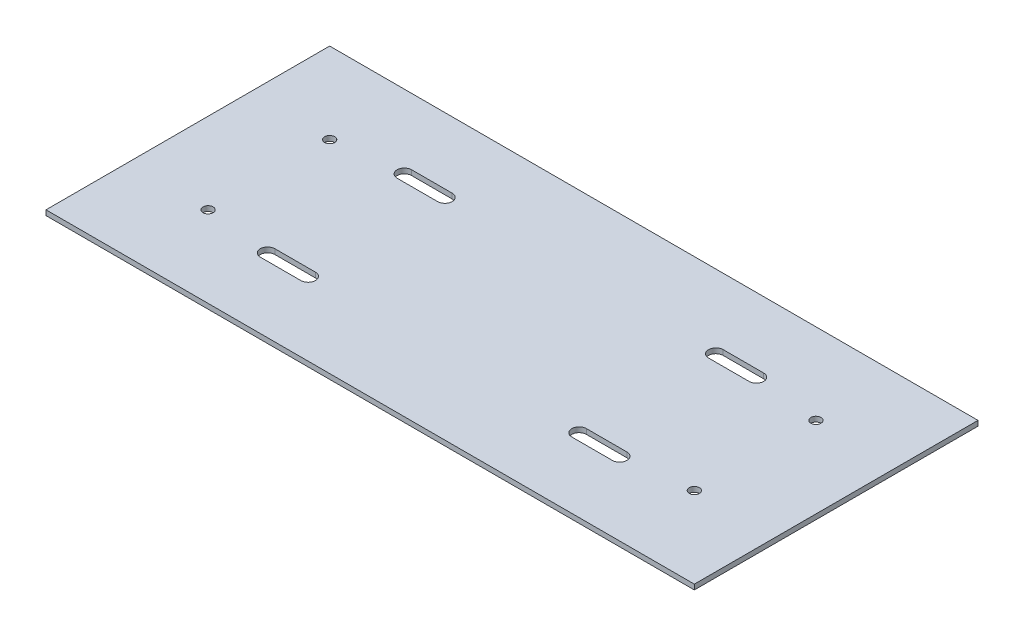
ISO-10303-21;
HEADER;
FILE_DESCRIPTION(('STEP AP214'),'2;1');
FILE_NAME('part.step','',(''),(''),'','','');
FILE_SCHEMA(('AUTOMOTIVE_DESIGN { 1 0 10303 214 1 1 1 1 }'));
ENDSEC;
DATA;
#1=APPLICATION_CONTEXT('core data for automotive mechanical design processes');
#2=APPLICATION_PROTOCOL_DEFINITION('international standard','automotive_design',2000,#1);
#3=PRODUCT_CONTEXT('',#1,'mechanical');
#4=PRODUCT('Part','Part','',(#3));
#5=PRODUCT_RELATED_PRODUCT_CATEGORY('part','',(#4));
#6=PRODUCT_DEFINITION_FORMATION('','',#4);
#7=PRODUCT_DEFINITION_CONTEXT('part definition',#1,'design');
#8=PRODUCT_DEFINITION('design','',#6,#7);
#9=PRODUCT_DEFINITION_SHAPE('','',#8);
#10=(LENGTH_UNIT() NAMED_UNIT(*) SI_UNIT(.MILLI.,.METRE.));
#11=(NAMED_UNIT(*) PLANE_ANGLE_UNIT() SI_UNIT($,.RADIAN.));
#12=(NAMED_UNIT(*) SI_UNIT($,.STERADIAN.) SOLID_ANGLE_UNIT());
#13=UNCERTAINTY_MEASURE_WITH_UNIT(LENGTH_MEASURE(1.E-05),#10,'distance_accuracy_value','');
#14=(GEOMETRIC_REPRESENTATION_CONTEXT(3) GLOBAL_UNCERTAINTY_ASSIGNED_CONTEXT((#13)) GLOBAL_UNIT_ASSIGNED_CONTEXT((#10,
#11,#12)) REPRESENTATION_CONTEXT('',''));
#15=CARTESIAN_POINT('',(0.,0.,0.));
#16=DIRECTION('',(0.,0.,1.));
#17=DIRECTION('',(1.,0.,0.));
#18=AXIS2_PLACEMENT_3D('',#15,#16,#17);
#19=CARTESIAN_POINT('',(-203.2,3.175,177.8));
#20=DIRECTION('',(1.,0.,0.));
#21=DIRECTION('',(0.,0.,-1.));
#22=AXIS2_PLACEMENT_3D('',#19,#20,#21);
#23=PLANE('',#22);
#24=DIRECTION('',(0.,0.,-1.));
#25=VECTOR('',#24,1.);
#26=CARTESIAN_POINT('',(-203.2,0.,177.8));
#27=LINE('',#26,#25);
#28=CARTESIAN_POINT('',(-203.2,0.,88.9));
#29=VERTEX_POINT('',#28);
#30=CARTESIAN_POINT('',(-203.2,0.,-88.9));
#31=VERTEX_POINT('',#30);
#32=EDGE_CURVE('E11',#29,#31,#27,.T.);
#33=ORIENTED_EDGE('',*,*,#32,.F.);
#34=DIRECTION('',(0.,1.,0.));
#35=VECTOR('',#34,1.);
#36=CARTESIAN_POINT('',(-203.2,-0.00100000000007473,88.9));
#37=LINE('',#36,#35);
#38=CARTESIAN_POINT('',(-203.2,3.175,88.9));
#39=VERTEX_POINT('',#38);
#40=EDGE_CURVE('E331',#29,#39,#37,.T.);
#41=ORIENTED_EDGE('',*,*,#40,.T.);
#42=DIRECTION('',(0.,0.,-1.));
#43=VECTOR('',#42,1.);
#44=CARTESIAN_POINT('',(-203.2,3.175,177.8));
#45=LINE('',#44,#43);
#46=CARTESIAN_POINT('',(-203.2,3.175,-88.8999999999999));
#47=VERTEX_POINT('',#46);
#48=EDGE_CURVE('E347',#39,#47,#45,.T.);
#49=ORIENTED_EDGE('',*,*,#48,.T.);
#50=DIRECTION('',(0.,1.,0.));
#51=VECTOR('',#50,1.);
#52=CARTESIAN_POINT('',(-203.2,-0.00100000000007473,-88.9));
#53=LINE('',#52,#51);
#54=EDGE_CURVE('E343',#31,#47,#53,.T.);
#55=ORIENTED_EDGE('',*,*,#54,.F.);
#56=EDGE_LOOP('',(#33,#41,#49,#55));
#57=FACE_BOUND('',#56,.T.);
#58=ADVANCED_FACE('F35',(#57),#23,.F.);
#59=CARTESIAN_POINT('',(-203.2,0.,177.8));
#60=DIRECTION('',(0.,1.,0.));
#61=DIRECTION('',(-1.,0.,0.));
#62=AXIS2_PLACEMENT_3D('',#59,#60,#61);
#63=PLANE('',#62);
#64=DIRECTION('',(-1.,0.,0.));
#65=VECTOR('',#64,1.);
#66=CARTESIAN_POINT('',(110.337600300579,0.,-47.4345));
#67=LINE('',#66,#65);
#68=CARTESIAN_POINT('',(110.337600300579,0.,-47.4345));
#69=VERTEX_POINT('',#68);
#70=CARTESIAN_POINT('',(84.9375996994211,0.,-47.4345));
#71=VERTEX_POINT('',#70);
#72=EDGE_CURVE('E182',#69,#71,#67,.T.);
#73=ORIENTED_EDGE('',*,*,#72,.T.);
#74=CARTESIAN_POINT('',(84.9376003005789,0.,-42.8625));
#75=DIRECTION('',(0.,1.,0.));
#76=DIRECTION('',(1.,0.,0.));
#77=AXIS2_PLACEMENT_3D('',#74,#75,#76);
#78=CIRCLE('',#77,4.57200000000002);
#79=CARTESIAN_POINT('',(84.9376003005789,0.,-38.2905));
#80=VERTEX_POINT('',#79);
#81=EDGE_CURVE('E174',#71,#80,#78,.T.);
#82=ORIENTED_EDGE('',*,*,#81,.T.);
#83=DIRECTION('',(1.,0.,0.));
#84=VECTOR('',#83,1.);
#85=CARTESIAN_POINT('',(110.337600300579,0.,-38.2905));
#86=LINE('',#85,#84);
#87=CARTESIAN_POINT('',(110.337600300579,0.,-38.2905));
#88=VERTEX_POINT('',#87);
#89=EDGE_CURVE('E185',#80,#88,#86,.T.);
#90=ORIENTED_EDGE('',*,*,#89,.T.);
#91=CARTESIAN_POINT('',(110.337600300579,0.,-42.8625));
#92=DIRECTION('',(0.,1.,0.));
#93=DIRECTION('',(1.,0.,0.));
#94=AXIS2_PLACEMENT_3D('',#91,#92,#93);
#95=CIRCLE('',#94,4.57199999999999);
#96=EDGE_CURVE('E49',#88,#69,#95,.T.);
#97=ORIENTED_EDGE('',*,*,#96,.T.);
#98=EDGE_LOOP('',(#73,#82,#90,#97));
#99=FACE_BOUND('',#98,.T.);
#100=DIRECTION('',(1.,0.,0.));
#101=VECTOR('',#100,1.);
#102=CARTESIAN_POINT('',(110.337600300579,0.,47.4345));
#103=LINE('',#102,#101);
#104=CARTESIAN_POINT('',(84.9375996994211,0.,47.4345));
#105=VERTEX_POINT('',#104);
#106=CARTESIAN_POINT('',(110.337600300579,0.,47.4345));
#107=VERTEX_POINT('',#106);
#108=EDGE_CURVE('E220',#105,#107,#103,.T.);
#109=ORIENTED_EDGE('',*,*,#108,.T.);
#110=CARTESIAN_POINT('',(110.337600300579,0.,42.8625));
#111=DIRECTION('',(0.,1.,0.));
#112=DIRECTION('',(-1.,0.,0.));
#113=AXIS2_PLACEMENT_3D('',#110,#111,#112);
#114=CIRCLE('',#113,4.57199999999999);
#115=CARTESIAN_POINT('',(110.337600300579,0.,38.2905));
#116=VERTEX_POINT('',#115);
#117=EDGE_CURVE('E212',#107,#116,#114,.T.);
#118=ORIENTED_EDGE('',*,*,#117,.T.);
#119=DIRECTION('',(-1.,0.,0.));
#120=VECTOR('',#119,1.);
#121=CARTESIAN_POINT('',(110.337600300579,0.,38.2905));
#122=LINE('',#121,#120);
#123=CARTESIAN_POINT('',(84.9376003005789,0.,38.2905));
#124=VERTEX_POINT('',#123);
#125=EDGE_CURVE('E215',#116,#124,#122,.T.);
#126=ORIENTED_EDGE('',*,*,#125,.T.);
#127=CARTESIAN_POINT('',(84.9376003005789,0.,42.8625));
#128=DIRECTION('',(0.,1.,0.));
#129=DIRECTION('',(-1.,0.,0.));
#130=AXIS2_PLACEMENT_3D('',#127,#128,#129);
#131=CIRCLE('',#130,4.57200000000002);
#132=EDGE_CURVE('E57',#124,#105,#131,.T.);
#133=ORIENTED_EDGE('',*,*,#132,.T.);
#134=EDGE_LOOP('',(#109,#118,#126,#133));
#135=FACE_BOUND('',#134,.T.);
#136=DIRECTION('',(1.,0.,0.));
#137=VECTOR('',#136,1.);
#138=CARTESIAN_POINT('',(-110.337600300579,-1.23599047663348E-13,47.4345));
#139=LINE('',#138,#137);
#140=CARTESIAN_POINT('',(-110.337600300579,-1.23599047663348E-13,47.4345));
#141=VERTEX_POINT('',#140);
#142=CARTESIAN_POINT('',(-84.9375996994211,-1.18828558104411E-13,47.4345));
#143=VERTEX_POINT('',#142);
#144=EDGE_CURVE('E252',#141,#143,#139,.T.);
#145=ORIENTED_EDGE('',*,*,#144,.T.);
#146=CARTESIAN_POINT('',(-84.9376003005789,-1.18828558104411E-13,42.8625));
#147=DIRECTION('',(0.,1.,0.));
#148=DIRECTION('',(1.,0.,0.));
#149=AXIS2_PLACEMENT_3D('',#146,#147,#148);
#150=CIRCLE('',#149,4.57200000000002);
#151=CARTESIAN_POINT('',(-84.9376003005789,-1.18828558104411E-13,38.2905));
#152=VERTEX_POINT('',#151);
#153=EDGE_CURVE('E242',#143,#152,#150,.T.);
#154=ORIENTED_EDGE('',*,*,#153,.T.);
#155=DIRECTION('',(-1.,0.,0.));
#156=VECTOR('',#155,1.);
#157=CARTESIAN_POINT('',(-110.337600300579,-1.23599047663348E-13,38.2905));
#158=LINE('',#157,#156);
#159=CARTESIAN_POINT('',(-110.337600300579,0.,38.2905));
#160=VERTEX_POINT('',#159);
#161=EDGE_CURVE('E245',#152,#160,#158,.T.);
#162=ORIENTED_EDGE('',*,*,#161,.T.);
#163=CARTESIAN_POINT('',(-110.337600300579,-1.23599047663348E-13,42.8625));
#164=DIRECTION('',(0.,1.,0.));
#165=DIRECTION('',(1.,0.,0.));
#166=AXIS2_PLACEMENT_3D('',#163,#164,#165);
#167=CIRCLE('',#166,4.57199999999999);
#168=EDGE_CURVE('E249',#160,#141,#167,.T.);
#169=ORIENTED_EDGE('',*,*,#168,.T.);
#170=EDGE_LOOP('',(#145,#154,#162,#169));
#171=FACE_BOUND('',#170,.T.);
#172=DIRECTION('',(-1.,0.,0.));
#173=VECTOR('',#172,1.);
#174=CARTESIAN_POINT('',(-110.337600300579,-1.23599047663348E-13,-47.4345));
#175=LINE('',#174,#173);
#176=CARTESIAN_POINT('',(-84.9375996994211,-1.18828558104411E-13,-47.4345));
#177=VERTEX_POINT('',#176);
#178=CARTESIAN_POINT('',(-110.337600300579,-1.23599047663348E-13,-47.4345));
#179=VERTEX_POINT('',#178);
#180=EDGE_CURVE('E283',#177,#179,#175,.T.);
#181=ORIENTED_EDGE('',*,*,#180,.T.);
#182=CARTESIAN_POINT('',(-110.337600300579,-1.23599047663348E-13,-42.8625));
#183=DIRECTION('',(0.,1.,0.));
#184=DIRECTION('',(-1.,0.,0.));
#185=AXIS2_PLACEMENT_3D('',#182,#183,#184);
#186=CIRCLE('',#185,4.57199999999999);
#187=CARTESIAN_POINT('',(-110.337600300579,-1.23599047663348E-13,-38.2905));
#188=VERTEX_POINT('',#187);
#189=EDGE_CURVE('E273',#179,#188,#186,.T.);
#190=ORIENTED_EDGE('',*,*,#189,.T.);
#191=DIRECTION('',(1.,0.,0.));
#192=VECTOR('',#191,1.);
#193=CARTESIAN_POINT('',(-110.337600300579,-1.23599047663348E-13,-38.2905));
#194=LINE('',#193,#192);
#195=CARTESIAN_POINT('',(-84.9376003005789,0.,-38.2905));
#196=VERTEX_POINT('',#195);
#197=EDGE_CURVE('E276',#188,#196,#194,.T.);
#198=ORIENTED_EDGE('',*,*,#197,.T.);
#199=CARTESIAN_POINT('',(-84.9376003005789,-1.18828558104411E-13,-42.8625));
#200=DIRECTION('',(0.,1.,0.));
#201=DIRECTION('',(-1.,0.,0.));
#202=AXIS2_PLACEMENT_3D('',#199,#200,#201);
#203=CIRCLE('',#202,4.57200000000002);
#204=EDGE_CURVE('E280',#196,#177,#203,.T.);
#205=ORIENTED_EDGE('',*,*,#204,.T.);
#206=EDGE_LOOP('',(#181,#190,#198,#205));
#207=FACE_BOUND('',#206,.T.);
#208=CARTESIAN_POINT('',(-152.4,0.,38.1));
#209=DIRECTION('',(0.,1.,0.));
#210=DIRECTION('',(-1.,0.,0.));
#211=AXIS2_PLACEMENT_3D('',#208,#209,#210);
#212=CIRCLE('',#211,3.17499999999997);
#213=CARTESIAN_POINT('',(-155.575,0.,38.1));
#214=VERTEX_POINT('',#213);
#215=EDGE_CURVE('E305',#214,#214,#212,.T.);
#216=ORIENTED_EDGE('',*,*,#215,.T.);
#217=EDGE_LOOP('',(#216));
#218=FACE_BOUND('',#217,.T.);
#219=CARTESIAN_POINT('',(152.4,0.,38.1));
#220=DIRECTION('',(0.,1.,0.));
#221=DIRECTION('',(1.,0.,0.));
#222=AXIS2_PLACEMENT_3D('',#219,#220,#221);
#223=CIRCLE('',#222,3.17499999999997);
#224=CARTESIAN_POINT('',(155.575,0.,38.1));
#225=VERTEX_POINT('',#224);
#226=EDGE_CURVE('E312',#225,#225,#223,.T.);
#227=ORIENTED_EDGE('',*,*,#226,.T.);
#228=EDGE_LOOP('',(#227));
#229=FACE_BOUND('',#228,.T.);
#230=CARTESIAN_POINT('',(152.4,0.,-38.1));
#231=DIRECTION('',(0.,1.,0.));
#232=DIRECTION('',(1.,0.,0.));
#233=AXIS2_PLACEMENT_3D('',#230,#231,#232);
#234=CIRCLE('',#233,3.175);
#235=CARTESIAN_POINT('',(155.575,0.,-38.1));
#236=VERTEX_POINT('',#235);
#237=EDGE_CURVE('E318',#236,#236,#234,.T.);
#238=ORIENTED_EDGE('',*,*,#237,.T.);
#239=EDGE_LOOP('',(#238));
#240=FACE_BOUND('',#239,.T.);
#241=CARTESIAN_POINT('',(-152.4,0.,-38.1));
#242=DIRECTION('',(0.,1.,0.));
#243=DIRECTION('',(-1.,0.,0.));
#244=AXIS2_PLACEMENT_3D('',#241,#242,#243);
#245=CIRCLE('',#244,3.175);
#246=CARTESIAN_POINT('',(-155.575,0.,-38.1));
#247=VERTEX_POINT('',#246);
#248=EDGE_CURVE('E323',#247,#247,#245,.T.);
#249=ORIENTED_EDGE('',*,*,#248,.T.);
#250=EDGE_LOOP('',(#249));
#251=FACE_BOUND('',#250,.T.);
#252=DIRECTION('',(0.,0.,-1.));
#253=VECTOR('',#252,1.);
#254=CARTESIAN_POINT('',(203.2,0.,177.8));
#255=LINE('',#254,#253);
#256=CARTESIAN_POINT('',(203.2,0.,88.9));
#257=VERTEX_POINT('',#256);
#258=CARTESIAN_POINT('',(203.2,0.,-88.9));
#259=VERTEX_POINT('',#258);
#260=EDGE_CURVE('E42',#257,#259,#255,.T.);
#261=ORIENTED_EDGE('',*,*,#260,.F.);
#262=DIRECTION('',(1.,0.,0.));
#263=VECTOR('',#262,1.);
#264=CARTESIAN_POINT('',(-203.2,0.,88.9));
#265=LINE('',#264,#263);
#266=EDGE_CURVE('E334',#29,#257,#265,.T.);
#267=ORIENTED_EDGE('',*,*,#266,.F.);
#268=ORIENTED_EDGE('',*,*,#32,.T.);
#269=DIRECTION('',(-1.,0.,0.));
#270=VECTOR('',#269,1.);
#271=CARTESIAN_POINT('',(-203.2,0.,-88.9));
#272=LINE('',#271,#270);
#273=EDGE_CURVE('E337',#259,#31,#272,.T.);
#274=ORIENTED_EDGE('',*,*,#273,.F.);
#275=EDGE_LOOP('',(#261,#267,#268,#274));
#276=FACE_BOUND('',#275,.T.);
#277=ADVANCED_FACE('F189',(#99,#135,#171,#207,#218,#229,#240,#251,#276),#63,.F.);
#278=CARTESIAN_POINT('',(203.2,0.,177.8));
#279=DIRECTION('',(-1.,0.,0.));
#280=DIRECTION('',(0.,0.,1.));
#281=AXIS2_PLACEMENT_3D('',#278,#279,#280);
#282=PLANE('',#281);
#283=DIRECTION('',(0.,0.,-1.));
#284=VECTOR('',#283,1.);
#285=CARTESIAN_POINT('',(203.2,3.17500000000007,177.8));
#286=LINE('',#285,#284);
#287=CARTESIAN_POINT('',(203.2,3.17500000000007,88.9));
#288=VERTEX_POINT('',#287);
#289=CARTESIAN_POINT('',(203.2,3.17500000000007,-88.9));
#290=VERTEX_POINT('',#289);
#291=EDGE_CURVE('E351',#288,#290,#286,.T.);
#292=ORIENTED_EDGE('',*,*,#291,.F.);
#293=DIRECTION('',(0.,1.,0.));
#294=VECTOR('',#293,1.);
#295=CARTESIAN_POINT('',(203.2,-0.00100000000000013,88.9));
#296=LINE('',#295,#294);
#297=EDGE_CURVE('E330',#257,#288,#296,.T.);
#298=ORIENTED_EDGE('',*,*,#297,.F.);
#299=ORIENTED_EDGE('',*,*,#260,.T.);
#300=DIRECTION('',(0.,1.,0.));
#301=VECTOR('',#300,1.);
#302=CARTESIAN_POINT('',(203.2,-0.00100000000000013,-88.9));
#303=LINE('',#302,#301);
#304=EDGE_CURVE('E344',#259,#290,#303,.T.);
#305=ORIENTED_EDGE('',*,*,#304,.T.);
#306=EDGE_LOOP('',(#292,#298,#299,#305));
#307=FACE_BOUND('',#306,.T.);
#308=ADVANCED_FACE('F357',(#307),#282,.F.);
#309=CARTESIAN_POINT('',(203.2,3.17500000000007,177.8));
#310=DIRECTION('',(0.,-1.,0.));
#311=DIRECTION('',(1.,0.,0.));
#312=AXIS2_PLACEMENT_3D('',#309,#310,#311);
#313=PLANE('',#312);
#314=DIRECTION('',(1.,0.,0.));
#315=VECTOR('',#314,1.);
#316=CARTESIAN_POINT('',(110.337600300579,3.17500000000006,-38.2905));
#317=LINE('',#316,#315);
#318=CARTESIAN_POINT('',(84.9376003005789,3.17500000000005,-38.2905));
#319=VERTEX_POINT('',#318);
#320=CARTESIAN_POINT('',(110.337600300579,3.17500000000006,-38.2905));
#321=VERTEX_POINT('',#320);
#322=EDGE_CURVE('E201',#319,#321,#317,.T.);
#323=ORIENTED_EDGE('',*,*,#322,.F.);
#324=CARTESIAN_POINT('',(84.9376003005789,3.17500000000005,-42.8625));
#325=DIRECTION('',(0.,1.,0.));
#326=DIRECTION('',(1.,0.,0.));
#327=AXIS2_PLACEMENT_3D('',#324,#325,#326);
#328=CIRCLE('',#327,4.57200000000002);
#329=CARTESIAN_POINT('',(84.9375996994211,3.17500000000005,-47.4345));
#330=VERTEX_POINT('',#329);
#331=EDGE_CURVE('E177',#330,#319,#328,.T.);
#332=ORIENTED_EDGE('',*,*,#331,.F.);
#333=DIRECTION('',(-1.,0.,0.));
#334=VECTOR('',#333,1.);
#335=CARTESIAN_POINT('',(110.337600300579,3.17500000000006,-47.4345));
#336=LINE('',#335,#334);
#337=CARTESIAN_POINT('',(110.337600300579,3.17500000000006,-47.4345));
#338=VERTEX_POINT('',#337);
#339=EDGE_CURVE('E192',#338,#330,#336,.T.);
#340=ORIENTED_EDGE('',*,*,#339,.F.);
#341=CARTESIAN_POINT('',(110.337600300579,3.17500000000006,-42.8625));
#342=DIRECTION('',(0.,1.,0.));
#343=DIRECTION('',(1.,0.,0.));
#344=AXIS2_PLACEMENT_3D('',#341,#342,#343);
#345=CIRCLE('',#344,4.57199999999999);
#346=EDGE_CURVE('E195',#321,#338,#345,.T.);
#347=ORIENTED_EDGE('',*,*,#346,.F.);
#348=EDGE_LOOP('',(#323,#332,#340,#347));
#349=FACE_BOUND('',#348,.T.);
#350=DIRECTION('',(-1.,0.,0.));
#351=VECTOR('',#350,1.);
#352=CARTESIAN_POINT('',(110.337600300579,3.17500000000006,38.2905));
#353=LINE('',#352,#351);
#354=CARTESIAN_POINT('',(110.337600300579,3.17500000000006,38.2905));
#355=VERTEX_POINT('',#354);
#356=CARTESIAN_POINT('',(84.9376003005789,3.17500000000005,38.2905));
#357=VERTEX_POINT('',#356);
#358=EDGE_CURVE('E226',#355,#357,#353,.T.);
#359=ORIENTED_EDGE('',*,*,#358,.F.);
#360=CARTESIAN_POINT('',(110.337600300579,3.17500000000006,42.8625));
#361=DIRECTION('',(0.,1.,0.));
#362=DIRECTION('',(-1.,0.,0.));
#363=AXIS2_PLACEMENT_3D('',#360,#361,#362);
#364=CIRCLE('',#363,4.57199999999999);
#365=CARTESIAN_POINT('',(110.337600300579,3.17500000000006,47.4345));
#366=VERTEX_POINT('',#365);
#367=EDGE_CURVE('E224',#366,#355,#364,.T.);
#368=ORIENTED_EDGE('',*,*,#367,.F.);
#369=DIRECTION('',(1.,0.,0.));
#370=VECTOR('',#369,1.);
#371=CARTESIAN_POINT('',(110.337600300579,3.17500000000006,47.4345));
#372=LINE('',#371,#370);
#373=CARTESIAN_POINT('',(84.9375996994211,3.17500000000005,47.4345));
#374=VERTEX_POINT('',#373);
#375=EDGE_CURVE('E216',#374,#366,#372,.T.);
#376=ORIENTED_EDGE('',*,*,#375,.F.);
#377=CARTESIAN_POINT('',(84.9376003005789,3.17500000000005,42.8625));
#378=DIRECTION('',(0.,1.,0.));
#379=DIRECTION('',(-1.,0.,0.));
#380=AXIS2_PLACEMENT_3D('',#377,#378,#379);
#381=CIRCLE('',#380,4.57200000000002);
#382=EDGE_CURVE('E230',#357,#374,#381,.T.);
#383=ORIENTED_EDGE('',*,*,#382,.F.);
#384=EDGE_LOOP('',(#359,#368,#376,#383));
#385=FACE_BOUND('',#384,.T.);
#386=DIRECTION('',(-1.,0.,0.));
#387=VECTOR('',#386,1.);
#388=CARTESIAN_POINT('',(-110.337600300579,3.17500000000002,38.2905));
#389=LINE('',#388,#387);
#390=CARTESIAN_POINT('',(-84.9376003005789,3.17500000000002,38.2905));
#391=VERTEX_POINT('',#390);
#392=CARTESIAN_POINT('',(-110.337600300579,3.17500000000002,38.2905));
#393=VERTEX_POINT('',#392);
#394=EDGE_CURVE('E258',#391,#393,#389,.T.);
#395=ORIENTED_EDGE('',*,*,#394,.F.);
#396=CARTESIAN_POINT('',(-84.9376003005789,3.17500000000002,42.8625));
#397=DIRECTION('',(0.,1.,0.));
#398=DIRECTION('',(1.,0.,0.));
#399=AXIS2_PLACEMENT_3D('',#396,#397,#398);
#400=CIRCLE('',#399,4.57200000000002);
#401=CARTESIAN_POINT('',(-84.9375996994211,3.17500000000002,47.4345));
#402=VERTEX_POINT('',#401);
#403=EDGE_CURVE('E256',#402,#391,#400,.T.);
#404=ORIENTED_EDGE('',*,*,#403,.F.);
#405=DIRECTION('',(1.,0.,0.));
#406=VECTOR('',#405,1.);
#407=CARTESIAN_POINT('',(-110.337600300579,3.17500000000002,47.4345));
#408=LINE('',#407,#406);
#409=CARTESIAN_POINT('',(-110.337600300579,3.17500000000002,47.4345));
#410=VERTEX_POINT('',#409);
#411=EDGE_CURVE('E246',#410,#402,#408,.T.);
#412=ORIENTED_EDGE('',*,*,#411,.F.);
#413=CARTESIAN_POINT('',(-110.337600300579,3.17500000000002,42.8625));
#414=DIRECTION('',(0.,1.,0.));
#415=DIRECTION('',(1.,0.,0.));
#416=AXIS2_PLACEMENT_3D('',#413,#414,#415);
#417=CIRCLE('',#416,4.57199999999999);
#418=EDGE_CURVE('E261',#393,#410,#417,.T.);
#419=ORIENTED_EDGE('',*,*,#418,.F.);
#420=EDGE_LOOP('',(#395,#404,#412,#419));
#421=FACE_BOUND('',#420,.T.);
#422=DIRECTION('',(1.,0.,0.));
#423=VECTOR('',#422,1.);
#424=CARTESIAN_POINT('',(-110.337600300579,3.17500000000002,-38.2905));
#425=LINE('',#424,#423);
#426=CARTESIAN_POINT('',(-110.337600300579,3.17500000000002,-38.2905));
#427=VERTEX_POINT('',#426);
#428=CARTESIAN_POINT('',(-84.9376003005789,3.17500000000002,-38.2905));
#429=VERTEX_POINT('',#428);
#430=EDGE_CURVE('E288',#427,#429,#425,.T.);
#431=ORIENTED_EDGE('',*,*,#430,.F.);
#432=CARTESIAN_POINT('',(-110.337600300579,3.17500000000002,-42.8625));
#433=DIRECTION('',(0.,1.,0.));
#434=DIRECTION('',(-1.,0.,0.));
#435=AXIS2_PLACEMENT_3D('',#432,#433,#434);
#436=CIRCLE('',#435,4.57199999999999);
#437=CARTESIAN_POINT('',(-110.337600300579,3.17500000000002,-47.4345));
#438=VERTEX_POINT('',#437);
#439=EDGE_CURVE('E208',#438,#427,#436,.T.);
#440=ORIENTED_EDGE('',*,*,#439,.F.);
#441=DIRECTION('',(-1.,0.,0.));
#442=VECTOR('',#441,1.);
#443=CARTESIAN_POINT('',(-110.337600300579,3.17500000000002,-47.4345));
#444=LINE('',#443,#442);
#445=CARTESIAN_POINT('',(-84.9375996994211,3.17500000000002,-47.4345));
#446=VERTEX_POINT('',#445);
#447=EDGE_CURVE('E277',#446,#438,#444,.T.);
#448=ORIENTED_EDGE('',*,*,#447,.F.);
#449=CARTESIAN_POINT('',(-84.9376003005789,3.17500000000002,-42.8625));
#450=DIRECTION('',(0.,1.,0.));
#451=DIRECTION('',(-1.,0.,0.));
#452=AXIS2_PLACEMENT_3D('',#449,#450,#451);
#453=CIRCLE('',#452,4.57200000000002);
#454=EDGE_CURVE('E291',#429,#446,#453,.T.);
#455=ORIENTED_EDGE('',*,*,#454,.F.);
#456=EDGE_LOOP('',(#431,#440,#448,#455));
#457=FACE_BOUND('',#456,.T.);
#458=CARTESIAN_POINT('',(-152.4,3.17500000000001,38.1));
#459=DIRECTION('',(0.,1.,0.));
#460=DIRECTION('',(-1.,0.,0.));
#461=AXIS2_PLACEMENT_3D('',#458,#459,#460);
#462=CIRCLE('',#461,3.17499999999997);
#463=CARTESIAN_POINT('',(-155.575,3.17500000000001,38.1));
#464=VERTEX_POINT('',#463);
#465=EDGE_CURVE('E309',#464,#464,#462,.T.);
#466=ORIENTED_EDGE('',*,*,#465,.F.);
#467=EDGE_LOOP('',(#466));
#468=FACE_BOUND('',#467,.T.);
#469=CARTESIAN_POINT('',(152.4,3.17500000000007,38.1));
#470=DIRECTION('',(0.,1.,0.));
#471=DIRECTION('',(1.,0.,0.));
#472=AXIS2_PLACEMENT_3D('',#469,#470,#471);
#473=CIRCLE('',#472,3.17499999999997);
#474=CARTESIAN_POINT('',(155.575,3.17500000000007,38.1));
#475=VERTEX_POINT('',#474);
#476=EDGE_CURVE('E315',#475,#475,#473,.T.);
#477=ORIENTED_EDGE('',*,*,#476,.F.);
#478=EDGE_LOOP('',(#477));
#479=FACE_BOUND('',#478,.T.);
#480=CARTESIAN_POINT('',(152.4,3.17500000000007,-38.1));
#481=DIRECTION('',(0.,1.,0.));
#482=DIRECTION('',(1.,0.,0.));
#483=AXIS2_PLACEMENT_3D('',#480,#481,#482);
#484=CIRCLE('',#483,3.175);
#485=CARTESIAN_POINT('',(155.575,3.17500000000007,-38.1));
#486=VERTEX_POINT('',#485);
#487=EDGE_CURVE('E298',#486,#486,#484,.T.);
#488=ORIENTED_EDGE('',*,*,#487,.F.);
#489=EDGE_LOOP('',(#488));
#490=FACE_BOUND('',#489,.T.);
#491=CARTESIAN_POINT('',(-152.4,3.17500000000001,-38.1));
#492=DIRECTION('',(0.,1.,0.));
#493=DIRECTION('',(-1.,0.,0.));
#494=AXIS2_PLACEMENT_3D('',#491,#492,#493);
#495=CIRCLE('',#494,3.175);
#496=CARTESIAN_POINT('',(-155.575,3.17500000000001,-38.1));
#497=VERTEX_POINT('',#496);
#498=EDGE_CURVE('E308',#497,#497,#495,.T.);
#499=ORIENTED_EDGE('',*,*,#498,.F.);
#500=EDGE_LOOP('',(#499));
#501=FACE_BOUND('',#500,.T.);
#502=ORIENTED_EDGE('',*,*,#48,.F.);
#503=DIRECTION('',(-1.,0.,0.));
#504=VECTOR('',#503,1.);
#505=CARTESIAN_POINT('',(-203.2,3.175,88.9));
#506=LINE('',#505,#504);
#507=EDGE_CURVE('E326',#288,#39,#506,.T.);
#508=ORIENTED_EDGE('',*,*,#507,.F.);
#509=ORIENTED_EDGE('',*,*,#291,.T.);
#510=DIRECTION('',(1.,0.,0.));
#511=VECTOR('',#510,1.);
#512=CARTESIAN_POINT('',(-203.2,3.175,-88.9));
#513=LINE('',#512,#511);
#514=EDGE_CURVE('E340',#47,#290,#513,.T.);
#515=ORIENTED_EDGE('',*,*,#514,.F.);
#516=EDGE_LOOP('',(#502,#508,#509,#515));
#517=FACE_BOUND('',#516,.T.);
#518=ADVANCED_FACE('F369',(#349,#385,#421,#457,#468,#479,#490,#501,#517),#313,.F.);
#519=CARTESIAN_POINT('',(-203.2,-0.00100000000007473,-88.9));
#520=DIRECTION('',(0.,0.,1.));
#521=DIRECTION('',(1.,0.,0.));
#522=AXIS2_PLACEMENT_3D('',#519,#520,#521);
#523=PLANE('',#522);
#524=ORIENTED_EDGE('',*,*,#273,.T.);
#525=ORIENTED_EDGE('',*,*,#54,.T.);
#526=ORIENTED_EDGE('',*,*,#514,.T.);
#527=ORIENTED_EDGE('',*,*,#304,.F.);
#528=EDGE_LOOP('',(#524,#525,#526,#527));
#529=FACE_BOUND('',#528,.T.);
#530=ADVANCED_FACE('F362',(#529),#523,.F.);
#531=CARTESIAN_POINT('',(-203.2,-0.00100000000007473,88.9));
#532=DIRECTION('',(0.,0.,-1.));
#533=DIRECTION('',(-1.,0.,0.));
#534=AXIS2_PLACEMENT_3D('',#531,#532,#533);
#535=PLANE('',#534);
#536=ORIENTED_EDGE('',*,*,#266,.T.);
#537=ORIENTED_EDGE('',*,*,#297,.T.);
#538=ORIENTED_EDGE('',*,*,#507,.T.);
#539=ORIENTED_EDGE('',*,*,#40,.F.);
#540=EDGE_LOOP('',(#536,#537,#538,#539));
#541=FACE_BOUND('',#540,.T.);
#542=ADVANCED_FACE('F372',(#541),#535,.F.);
#543=CARTESIAN_POINT('',(-152.4,0.,-38.1));
#544=DIRECTION('',(0.,1.,0.));
#545=DIRECTION('',(-1.,0.,0.));
#546=AXIS2_PLACEMENT_3D('',#543,#544,#545);
#547=CYLINDRICAL_SURFACE('',#546,3.175);
#548=ORIENTED_EDGE('',*,*,#248,.F.);
#549=EDGE_LOOP('',(#548));
#550=FACE_BOUND('',#549,.T.);
#551=ORIENTED_EDGE('',*,*,#498,.T.);
#552=EDGE_LOOP('',(#551));
#553=FACE_BOUND('',#552,.T.);
#554=ADVANCED_FACE('F374',(#550,#553),#547,.F.);
#555=CARTESIAN_POINT('',(152.4,0.,-38.1));
#556=DIRECTION('',(0.,1.,0.));
#557=DIRECTION('',(-1.,0.,0.));
#558=AXIS2_PLACEMENT_3D('',#555,#556,#557);
#559=CYLINDRICAL_SURFACE('',#558,3.175);
#560=ORIENTED_EDGE('',*,*,#237,.F.);
#561=EDGE_LOOP('',(#560));
#562=FACE_BOUND('',#561,.T.);
#563=ORIENTED_EDGE('',*,*,#487,.T.);
#564=EDGE_LOOP('',(#563));
#565=FACE_BOUND('',#564,.T.);
#566=ADVANCED_FACE('F380',(#562,#565),#559,.F.);
#567=CARTESIAN_POINT('',(152.4,0.,38.1));
#568=DIRECTION('',(0.,1.,0.));
#569=DIRECTION('',(-1.,0.,0.));
#570=AXIS2_PLACEMENT_3D('',#567,#568,#569);
#571=CYLINDRICAL_SURFACE('',#570,3.17499999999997);
#572=ORIENTED_EDGE('',*,*,#226,.F.);
#573=EDGE_LOOP('',(#572));
#574=FACE_BOUND('',#573,.T.);
#575=ORIENTED_EDGE('',*,*,#476,.T.);
#576=EDGE_LOOP('',(#575));
#577=FACE_BOUND('',#576,.T.);
#578=ADVANCED_FACE('F421',(#574,#577),#571,.F.);
#579=CARTESIAN_POINT('',(-152.4,0.,38.1));
#580=DIRECTION('',(0.,1.,0.));
#581=DIRECTION('',(-1.,0.,0.));
#582=AXIS2_PLACEMENT_3D('',#579,#580,#581);
#583=CYLINDRICAL_SURFACE('',#582,3.17499999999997);
#584=ORIENTED_EDGE('',*,*,#215,.F.);
#585=EDGE_LOOP('',(#584));
#586=FACE_BOUND('',#585,.T.);
#587=ORIENTED_EDGE('',*,*,#465,.T.);
#588=EDGE_LOOP('',(#587));
#589=FACE_BOUND('',#588,.T.);
#590=ADVANCED_FACE('F427',(#586,#589),#583,.F.);
#591=CARTESIAN_POINT('',(-110.337600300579,-1.23599047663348E-13,-42.8625));
#592=DIRECTION('',(0.,1.,0.));
#593=DIRECTION('',(-1.,0.,0.));
#594=AXIS2_PLACEMENT_3D('',#591,#592,#593);
#595=CYLINDRICAL_SURFACE('',#594,4.57199999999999);
#596=ORIENTED_EDGE('',*,*,#439,.T.);
#597=DIRECTION('',(0.,1.,0.));
#598=VECTOR('',#597,1.);
#599=CARTESIAN_POINT('',(-110.337600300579,-1.23599047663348E-13,-38.2905));
#600=LINE('',#599,#598);
#601=EDGE_CURVE('E286',#188,#427,#600,.T.);
#602=ORIENTED_EDGE('',*,*,#601,.F.);
#603=ORIENTED_EDGE('',*,*,#189,.F.);
#604=DIRECTION('',(0.,1.,0.));
#605=VECTOR('',#604,1.);
#606=CARTESIAN_POINT('',(-110.337600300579,-1.23599047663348E-13,-47.4345));
#607=LINE('',#606,#605);
#608=EDGE_CURVE('E296',#179,#438,#607,.T.);
#609=ORIENTED_EDGE('',*,*,#608,.T.);
#610=EDGE_LOOP('',(#596,#602,#603,#609));
#611=FACE_BOUND('',#610,.T.);
#612=ADVANCED_FACE('F434',(#611),#595,.F.);
#613=CARTESIAN_POINT('',(-110.337600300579,-1.23599047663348E-13,-47.4345));
#614=DIRECTION('',(0.,0.,-1.));
#615=DIRECTION('',(-1.,0.,0.));
#616=AXIS2_PLACEMENT_3D('',#613,#614,#615);
#617=PLANE('',#616);
#618=ORIENTED_EDGE('',*,*,#447,.T.);
#619=ORIENTED_EDGE('',*,*,#608,.F.);
#620=ORIENTED_EDGE('',*,*,#180,.F.);
#621=DIRECTION('',(0.,1.,0.));
#622=VECTOR('',#621,1.);
#623=CARTESIAN_POINT('',(-84.9375996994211,-1.18828558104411E-13,-47.4345));
#624=LINE('',#623,#622);
#625=EDGE_CURVE('E299',#177,#446,#624,.T.);
#626=ORIENTED_EDGE('',*,*,#625,.T.);
#627=EDGE_LOOP('',(#618,#619,#620,#626));
#628=FACE_BOUND('',#627,.T.);
#629=ADVANCED_FACE('F438',(#628),#617,.F.);
#630=CARTESIAN_POINT('',(-84.9376003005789,-1.18828558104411E-13,-42.8625));
#631=DIRECTION('',(0.,1.,0.));
#632=DIRECTION('',(-1.,0.,0.));
#633=AXIS2_PLACEMENT_3D('',#630,#631,#632);
#634=CYLINDRICAL_SURFACE('',#633,4.57200000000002);
#635=ORIENTED_EDGE('',*,*,#454,.T.);
#636=ORIENTED_EDGE('',*,*,#625,.F.);
#637=ORIENTED_EDGE('',*,*,#204,.F.);
#638=DIRECTION('',(0.,1.,0.));
#639=VECTOR('',#638,1.);
#640=CARTESIAN_POINT('',(-84.9376003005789,-1.18828558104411E-13,-38.2905));
#641=LINE('',#640,#639);
#642=EDGE_CURVE('E301',#196,#429,#641,.T.);
#643=ORIENTED_EDGE('',*,*,#642,.T.);
#644=EDGE_LOOP('',(#635,#636,#637,#643));
#645=FACE_BOUND('',#644,.T.);
#646=ADVANCED_FACE('F444',(#645),#634,.F.);
#647=CARTESIAN_POINT('',(-110.337600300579,-1.23599047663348E-13,-38.2905));
#648=DIRECTION('',(0.,0.,1.));
#649=DIRECTION('',(1.,0.,0.));
#650=AXIS2_PLACEMENT_3D('',#647,#648,#649);
#651=PLANE('',#650);
#652=ORIENTED_EDGE('',*,*,#430,.T.);
#653=ORIENTED_EDGE('',*,*,#642,.F.);
#654=ORIENTED_EDGE('',*,*,#197,.F.);
#655=ORIENTED_EDGE('',*,*,#601,.T.);
#656=EDGE_LOOP('',(#652,#653,#654,#655));
#657=FACE_BOUND('',#656,.T.);
#658=ADVANCED_FACE('F440',(#657),#651,.F.);
#659=CARTESIAN_POINT('',(-84.9376003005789,-1.18828558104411E-13,42.8625));
#660=DIRECTION('',(0.,1.,0.));
#661=DIRECTION('',(-1.,0.,0.));
#662=AXIS2_PLACEMENT_3D('',#659,#660,#661);
#663=CYLINDRICAL_SURFACE('',#662,4.57200000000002);
#664=ORIENTED_EDGE('',*,*,#403,.T.);
#665=DIRECTION('',(0.,1.,0.));
#666=VECTOR('',#665,1.);
#667=CARTESIAN_POINT('',(-84.9376003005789,-1.18828558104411E-13,38.2905));
#668=LINE('',#667,#666);
#669=EDGE_CURVE('E255',#152,#391,#668,.T.);
#670=ORIENTED_EDGE('',*,*,#669,.F.);
#671=ORIENTED_EDGE('',*,*,#153,.F.);
#672=DIRECTION('',(0.,1.,0.));
#673=VECTOR('',#672,1.);
#674=CARTESIAN_POINT('',(-84.9375996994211,-1.18828558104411E-13,47.4345));
#675=LINE('',#674,#673);
#676=EDGE_CURVE('E227',#143,#402,#675,.T.);
#677=ORIENTED_EDGE('',*,*,#676,.T.);
#678=EDGE_LOOP('',(#664,#670,#671,#677));
#679=FACE_BOUND('',#678,.T.);
#680=ADVANCED_FACE('F443',(#679),#663,.F.);
#681=CARTESIAN_POINT('',(-110.337600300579,-1.23599047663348E-13,47.4345));
#682=DIRECTION('',(0.,0.,1.));
#683=DIRECTION('',(1.,0.,0.));
#684=AXIS2_PLACEMENT_3D('',#681,#682,#683);
#685=PLANE('',#684);
#686=ORIENTED_EDGE('',*,*,#411,.T.);
#687=ORIENTED_EDGE('',*,*,#676,.F.);
#688=ORIENTED_EDGE('',*,*,#144,.F.);
#689=DIRECTION('',(0.,1.,0.));
#690=VECTOR('',#689,1.);
#691=CARTESIAN_POINT('',(-110.337600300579,-1.23599047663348E-13,47.4345));
#692=LINE('',#691,#690);
#693=EDGE_CURVE('E267',#141,#410,#692,.T.);
#694=ORIENTED_EDGE('',*,*,#693,.T.);
#695=EDGE_LOOP('',(#686,#687,#688,#694));
#696=FACE_BOUND('',#695,.T.);
#697=ADVANCED_FACE('F454',(#696),#685,.F.);
#698=CARTESIAN_POINT('',(-110.337600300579,-1.23599047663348E-13,42.8625));
#699=DIRECTION('',(0.,1.,0.));
#700=DIRECTION('',(-1.,0.,0.));
#701=AXIS2_PLACEMENT_3D('',#698,#699,#700);
#702=CYLINDRICAL_SURFACE('',#701,4.57199999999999);
#703=ORIENTED_EDGE('',*,*,#418,.T.);
#704=ORIENTED_EDGE('',*,*,#693,.F.);
#705=ORIENTED_EDGE('',*,*,#168,.F.);
#706=DIRECTION('',(0.,1.,0.));
#707=VECTOR('',#706,1.);
#708=CARTESIAN_POINT('',(-110.337600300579,-1.23599047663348E-13,38.2905));
#709=LINE('',#708,#707);
#710=EDGE_CURVE('E269',#160,#393,#709,.T.);
#711=ORIENTED_EDGE('',*,*,#710,.T.);
#712=EDGE_LOOP('',(#703,#704,#705,#711));
#713=FACE_BOUND('',#712,.T.);
#714=ADVANCED_FACE('F460',(#713),#702,.F.);
#715=CARTESIAN_POINT('',(-110.337600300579,-1.23599047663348E-13,38.2905));
#716=DIRECTION('',(0.,0.,-1.));
#717=DIRECTION('',(-1.,0.,0.));
#718=AXIS2_PLACEMENT_3D('',#715,#716,#717);
#719=PLANE('',#718);
#720=ORIENTED_EDGE('',*,*,#394,.T.);
#721=ORIENTED_EDGE('',*,*,#710,.F.);
#722=ORIENTED_EDGE('',*,*,#161,.F.);
#723=ORIENTED_EDGE('',*,*,#669,.T.);
#724=EDGE_LOOP('',(#720,#721,#722,#723));
#725=FACE_BOUND('',#724,.T.);
#726=ADVANCED_FACE('F456',(#725),#719,.F.);
#727=CARTESIAN_POINT('',(110.337600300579,0.,42.8625));
#728=DIRECTION('',(0.,1.,0.));
#729=DIRECTION('',(-1.,0.,0.));
#730=AXIS2_PLACEMENT_3D('',#727,#728,#729);
#731=CYLINDRICAL_SURFACE('',#730,4.57199999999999);
#732=ORIENTED_EDGE('',*,*,#367,.T.);
#733=DIRECTION('',(0.,1.,0.));
#734=VECTOR('',#733,1.);
#735=CARTESIAN_POINT('',(110.337600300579,0.,38.2905));
#736=LINE('',#735,#734);
#737=EDGE_CURVE('E223',#116,#355,#736,.T.);
#738=ORIENTED_EDGE('',*,*,#737,.F.);
#739=ORIENTED_EDGE('',*,*,#117,.F.);
#740=DIRECTION('',(0.,1.,0.));
#741=VECTOR('',#740,1.);
#742=CARTESIAN_POINT('',(110.337600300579,0.,47.4345));
#743=LINE('',#742,#741);
#744=EDGE_CURVE('E202',#107,#366,#743,.T.);
#745=ORIENTED_EDGE('',*,*,#744,.T.);
#746=EDGE_LOOP('',(#732,#738,#739,#745));
#747=FACE_BOUND('',#746,.T.);
#748=ADVANCED_FACE('F459',(#747),#731,.F.);
#749=CARTESIAN_POINT('',(110.337600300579,0.,47.4345));
#750=DIRECTION('',(0.,0.,1.));
#751=DIRECTION('',(1.,0.,0.));
#752=AXIS2_PLACEMENT_3D('',#749,#750,#751);
#753=PLANE('',#752);
#754=ORIENTED_EDGE('',*,*,#375,.T.);
#755=ORIENTED_EDGE('',*,*,#744,.F.);
#756=ORIENTED_EDGE('',*,*,#108,.F.);
#757=DIRECTION('',(0.,1.,0.));
#758=VECTOR('',#757,1.);
#759=CARTESIAN_POINT('',(84.9375996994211,0.,47.4345));
#760=LINE('',#759,#758);
#761=EDGE_CURVE('E236',#105,#374,#760,.T.);
#762=ORIENTED_EDGE('',*,*,#761,.T.);
#763=EDGE_LOOP('',(#754,#755,#756,#762));
#764=FACE_BOUND('',#763,.T.);
#765=ADVANCED_FACE('F470',(#764),#753,.F.);
#766=CARTESIAN_POINT('',(84.9376003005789,0.,42.8625));
#767=DIRECTION('',(0.,1.,0.));
#768=DIRECTION('',(-1.,0.,0.));
#769=AXIS2_PLACEMENT_3D('',#766,#767,#768);
#770=CYLINDRICAL_SURFACE('',#769,4.57200000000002);
#771=ORIENTED_EDGE('',*,*,#382,.T.);
#772=ORIENTED_EDGE('',*,*,#761,.F.);
#773=ORIENTED_EDGE('',*,*,#132,.F.);
#774=DIRECTION('',(0.,1.,0.));
#775=VECTOR('',#774,1.);
#776=CARTESIAN_POINT('',(84.9376003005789,0.,38.2905));
#777=LINE('',#776,#775);
#778=EDGE_CURVE('E238',#124,#357,#777,.T.);
#779=ORIENTED_EDGE('',*,*,#778,.T.);
#780=EDGE_LOOP('',(#771,#772,#773,#779));
#781=FACE_BOUND('',#780,.T.);
#782=ADVANCED_FACE('F475',(#781),#770,.F.);
#783=CARTESIAN_POINT('',(110.337600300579,0.,38.2905));
#784=DIRECTION('',(0.,0.,-1.));
#785=DIRECTION('',(-1.,0.,0.));
#786=AXIS2_PLACEMENT_3D('',#783,#784,#785);
#787=PLANE('',#786);
#788=ORIENTED_EDGE('',*,*,#358,.T.);
#789=ORIENTED_EDGE('',*,*,#778,.F.);
#790=ORIENTED_EDGE('',*,*,#125,.F.);
#791=ORIENTED_EDGE('',*,*,#737,.T.);
#792=EDGE_LOOP('',(#788,#789,#790,#791));
#793=FACE_BOUND('',#792,.T.);
#794=ADVANCED_FACE('F472',(#793),#787,.F.);
#795=CARTESIAN_POINT('',(84.9376003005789,0.,-42.8625));
#796=DIRECTION('',(0.,1.,0.));
#797=DIRECTION('',(-1.,0.,0.));
#798=AXIS2_PLACEMENT_3D('',#795,#796,#797);
#799=CYLINDRICAL_SURFACE('',#798,4.57200000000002);
#800=ORIENTED_EDGE('',*,*,#331,.T.);
#801=DIRECTION('',(0.,1.,0.));
#802=VECTOR('',#801,1.);
#803=CARTESIAN_POINT('',(84.9376003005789,0.,-38.2905));
#804=LINE('',#803,#802);
#805=EDGE_CURVE('E170',#80,#319,#804,.T.);
#806=ORIENTED_EDGE('',*,*,#805,.F.);
#807=ORIENTED_EDGE('',*,*,#81,.F.);
#808=DIRECTION('',(0.,1.,0.));
#809=VECTOR('',#808,1.);
#810=CARTESIAN_POINT('',(84.9375996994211,0.,-47.4345));
#811=LINE('',#810,#809);
#812=EDGE_CURVE('E206',#71,#330,#811,.T.);
#813=ORIENTED_EDGE('',*,*,#812,.T.);
#814=EDGE_LOOP('',(#800,#806,#807,#813));
#815=FACE_BOUND('',#814,.T.);
#816=ADVANCED_FACE('F172',(#815),#799,.F.);
#817=CARTESIAN_POINT('',(110.337600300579,0.,-47.4345));
#818=DIRECTION('',(0.,0.,-1.));
#819=DIRECTION('',(-1.,0.,0.));
#820=AXIS2_PLACEMENT_3D('',#817,#818,#819);
#821=PLANE('',#820);
#822=ORIENTED_EDGE('',*,*,#339,.T.);
#823=ORIENTED_EDGE('',*,*,#812,.F.);
#824=ORIENTED_EDGE('',*,*,#72,.F.);
#825=DIRECTION('',(0.,1.,0.));
#826=VECTOR('',#825,1.);
#827=CARTESIAN_POINT('',(110.337600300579,0.,-47.4345));
#828=LINE('',#827,#826);
#829=EDGE_CURVE('E209',#69,#338,#828,.T.);
#830=ORIENTED_EDGE('',*,*,#829,.T.);
#831=EDGE_LOOP('',(#822,#823,#824,#830));
#832=FACE_BOUND('',#831,.T.);
#833=ADVANCED_FACE('F484',(#832),#821,.F.);
#834=CARTESIAN_POINT('',(110.337600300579,0.,-42.8625));
#835=DIRECTION('',(0.,1.,0.));
#836=DIRECTION('',(-1.,0.,0.));
#837=AXIS2_PLACEMENT_3D('',#834,#835,#836);
#838=CYLINDRICAL_SURFACE('',#837,4.57199999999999);
#839=ORIENTED_EDGE('',*,*,#346,.T.);
#840=ORIENTED_EDGE('',*,*,#829,.F.);
#841=ORIENTED_EDGE('',*,*,#96,.F.);
#842=DIRECTION('',(0.,1.,0.));
#843=VECTOR('',#842,1.);
#844=CARTESIAN_POINT('',(110.337600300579,0.,-38.2905));
#845=LINE('',#844,#843);
#846=EDGE_CURVE('E181',#88,#321,#845,.T.);
#847=ORIENTED_EDGE('',*,*,#846,.T.);
#848=EDGE_LOOP('',(#839,#840,#841,#847));
#849=FACE_BOUND('',#848,.T.);
#850=ADVANCED_FACE('F487',(#849),#838,.F.);
#851=CARTESIAN_POINT('',(110.337600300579,0.,-38.2905));
#852=DIRECTION('',(0.,0.,1.));
#853=DIRECTION('',(1.,0.,0.));
#854=AXIS2_PLACEMENT_3D('',#851,#852,#853);
#855=PLANE('',#854);
#856=ORIENTED_EDGE('',*,*,#322,.T.);
#857=ORIENTED_EDGE('',*,*,#846,.F.);
#858=ORIENTED_EDGE('',*,*,#89,.F.);
#859=ORIENTED_EDGE('',*,*,#805,.T.);
#860=EDGE_LOOP('',(#856,#857,#858,#859));
#861=FACE_BOUND('',#860,.T.);
#862=ADVANCED_FACE('F186',(#861),#855,.F.);
#863=CLOSED_SHELL('',(#58,#277,#308,#518,#530,#542,#554,#566,#578,#590,#612,#629,#646,#658,#680,
#697,#714,#726,#748,#765,#782,#794,#816,#833,#850,#862));
#864=MANIFOLD_SOLID_BREP('B2',#863);
#865=ADVANCED_BREP_SHAPE_REPRESENTATION('',(#18,#864),#14);
#866=SHAPE_DEFINITION_REPRESENTATION(#9,#865);
ENDSEC;
END-ISO-10303-21;
